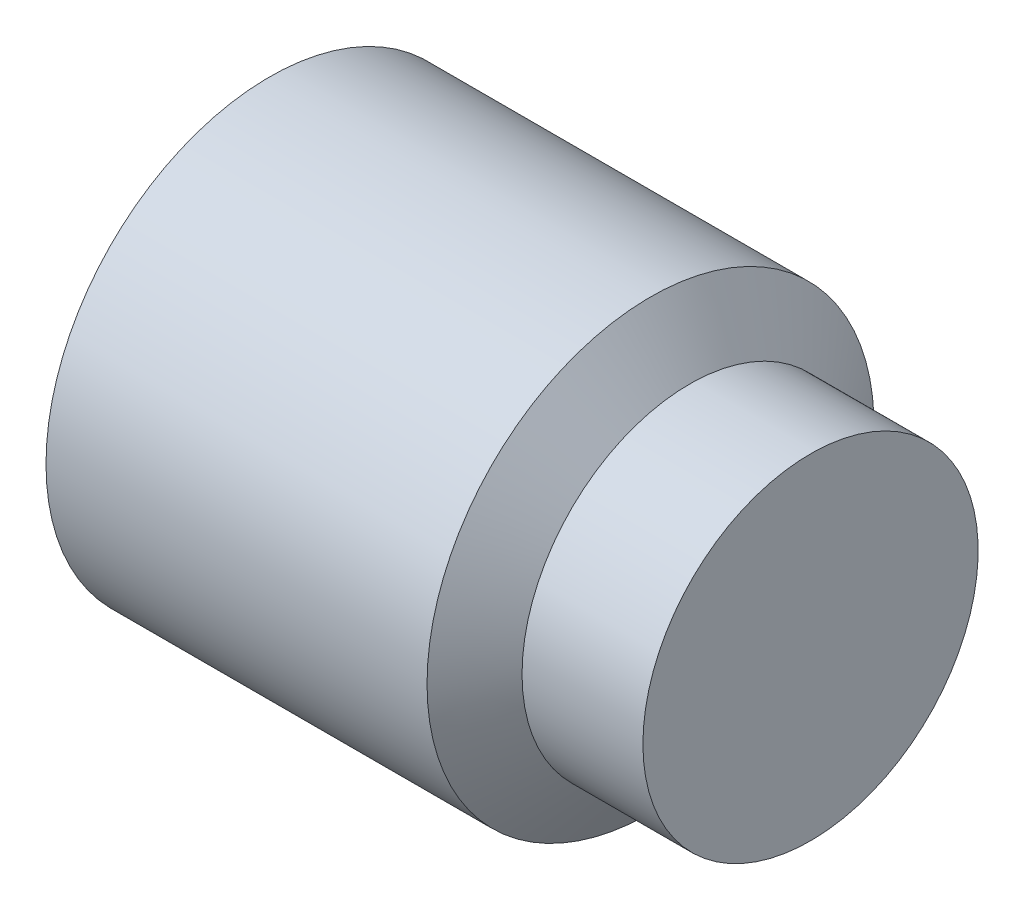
from build123d import *

# Parameters (mm, degrees)
HEX_2_DEPTH = 12


with BuildPart() as part:
    # BodySke → BaseBody (revolve)
    with BuildSketch(Plane.XY, mode=Mode.PRIVATE) as basebody_sk:
        Polygon((0, 0), (0, 10.352), (0.951473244, 12), (21.409377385, 12), (23.51, 9), (30, 9), (30, 0), align=None)
    revolve(basebody_sk.sketch.rotate(Axis((-12.7, 0, 0), (1, 0, 0)), 90), axis=Axis((-12.7, 0, 0), (1, 0, 0)))

    # Sketch2 → Hex 2 (cut)
    with BuildSketch(Plane.ZY):
        Polygon((3.464101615, 6), (-3.464101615, 6), (-6.92820323, 0), (-3.464101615, -6), (3.464101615, -6), (6.92820323, 0), align=None)
    extrude(amount=-HEX_2_DEPTH, mode=Mode.SUBTRACT)


solid = part.part
